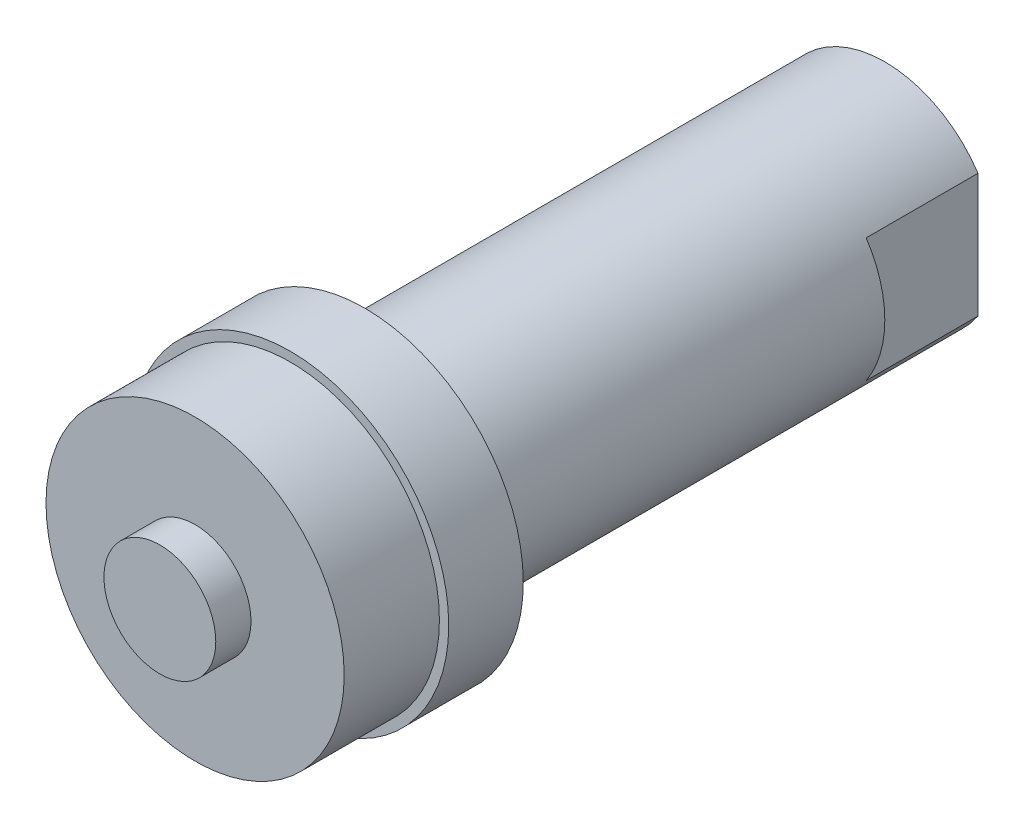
ISO-10303-21;
HEADER;
FILE_DESCRIPTION(('STEP AP214'),'2;1');
FILE_NAME('part.step','',(''),(''),'','','');
FILE_SCHEMA(('AUTOMOTIVE_DESIGN { 1 0 10303 214 1 1 1 1 }'));
ENDSEC;
DATA;
#1=APPLICATION_CONTEXT('core data for automotive mechanical design processes');
#2=APPLICATION_PROTOCOL_DEFINITION('international standard','automotive_design',2000,#1);
#3=PRODUCT_CONTEXT('',#1,'mechanical');
#4=PRODUCT('Part','Part','',(#3));
#5=PRODUCT_RELATED_PRODUCT_CATEGORY('part','',(#4));
#6=PRODUCT_DEFINITION_FORMATION('','',#4);
#7=PRODUCT_DEFINITION_CONTEXT('part definition',#1,'design');
#8=PRODUCT_DEFINITION('design','',#6,#7);
#9=PRODUCT_DEFINITION_SHAPE('','',#8);
#10=(LENGTH_UNIT() NAMED_UNIT(*) SI_UNIT(.MILLI.,.METRE.));
#11=(NAMED_UNIT(*) PLANE_ANGLE_UNIT() SI_UNIT($,.RADIAN.));
#12=(NAMED_UNIT(*) SI_UNIT($,.STERADIAN.) SOLID_ANGLE_UNIT());
#13=UNCERTAINTY_MEASURE_WITH_UNIT(LENGTH_MEASURE(1.E-05),#10,'distance_accuracy_value','');
#14=(GEOMETRIC_REPRESENTATION_CONTEXT(3) GLOBAL_UNCERTAINTY_ASSIGNED_CONTEXT((#13)) GLOBAL_UNIT_ASSIGNED_CONTEXT((#10,
#11,#12)) REPRESENTATION_CONTEXT('',''));
#15=CARTESIAN_POINT('',(0.,0.,0.));
#16=DIRECTION('',(0.,0.,1.));
#17=DIRECTION('',(1.,0.,0.));
#18=AXIS2_PLACEMENT_3D('',#15,#16,#17);
#19=CARTESIAN_POINT('',(0.,0.,-15.9));
#20=DIRECTION('',(0.,0.,-1.));
#21=DIRECTION('',(-1.,0.,0.));
#22=AXIS2_PLACEMENT_3D('',#19,#20,#21);
#23=PLANE('',#22);
#24=CARTESIAN_POINT('',(0.,0.,-15.8999999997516));
#25=DIRECTION('',(0.,0.,-1.));
#26=DIRECTION('',(-1.,0.,0.));
#27=AXIS2_PLACEMENT_3D('',#24,#25,#26);
#28=CIRCLE('',#27,3.);
#29=CARTESIAN_POINT('',(-3.,0.,-15.8999999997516));
#30=VERTEX_POINT('',#29);
#31=EDGE_CURVE('E18',#30,#30,#28,.F.);
#32=ORIENTED_EDGE('',*,*,#31,.F.);
#33=EDGE_LOOP('',(#32));
#34=FACE_BOUND('',#33,.T.);
#35=ADVANCED_FACE('F14',(#34),#23,.T.);
#36=CARTESIAN_POINT('',(0.,0.,-15.9));
#37=DIRECTION('',(0.,0.,-1.));
#38=DIRECTION('',(-1.,0.,0.));
#39=AXIS2_PLACEMENT_3D('',#36,#37,#38);
#40=CYLINDRICAL_SURFACE('',#39,3.);
#41=ORIENTED_EDGE('',*,*,#31,.T.);
#42=EDGE_LOOP('',(#41));
#43=FACE_BOUND('',#42,.T.);
#44=CARTESIAN_POINT('',(0.,0.,-27.9));
#45=DIRECTION('',(0.,0.,-1.));
#46=DIRECTION('',(-1.,0.,0.));
#47=AXIS2_PLACEMENT_3D('',#44,#45,#46);
#48=CIRCLE('',#47,3.);
#49=CARTESIAN_POINT('',(-3.,0.,-27.9));
#50=VERTEX_POINT('',#49);
#51=EDGE_CURVE('E107',#50,#50,#48,.F.);
#52=ORIENTED_EDGE('',*,*,#51,.F.);
#53=EDGE_LOOP('',(#52));
#54=FACE_BOUND('',#53,.T.);
#55=ADVANCED_FACE('F244',(#43,#54),#40,.F.);
#56=CARTESIAN_POINT('',(-6.,-7.5,-21.9));
#57=DIRECTION('',(0.,0.,1.));
#58=DIRECTION('',(1.,0.,0.));
#59=AXIS2_PLACEMENT_3D('',#56,#57,#58);
#60=PLANE('',#59);
#61=DIRECTION('',(0.,1.,0.));
#62=VECTOR('',#61,1.);
#63=CARTESIAN_POINT('',(-5.,-7.5,-21.9));
#64=LINE('',#63,#62);
#65=CARTESIAN_POINT('',(-5.00000000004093,-3.316624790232,-21.8999999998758));
#66=VERTEX_POINT('',#65);
#67=CARTESIAN_POINT('',(-5.00000000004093,3.316624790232,-21.8999999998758));
#68=VERTEX_POINT('',#67);
#69=EDGE_CURVE('E84',#66,#68,#64,.T.);
#70=ORIENTED_EDGE('',*,*,#69,.F.);
#71=CARTESIAN_POINT('',(0.,0.,-21.8999999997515));
#72=DIRECTION('',(0.,0.,1.));
#73=DIRECTION('',(1.,0.,0.));
#74=AXIS2_PLACEMENT_3D('',#71,#72,#73);
#75=CIRCLE('',#74,6.);
#76=EDGE_CURVE('E78',#68,#66,#75,.T.);
#77=ORIENTED_EDGE('',*,*,#76,.F.);
#78=EDGE_LOOP('',(#70,#77));
#79=FACE_BOUND('',#78,.T.);
#80=ADVANCED_FACE('F127',(#79),#60,.F.);
#81=CARTESIAN_POINT('',(-5.,-7.5,-21.9));
#82=DIRECTION('',(1.,0.,0.));
#83=DIRECTION('',(0.,0.,-1.));
#84=AXIS2_PLACEMENT_3D('',#81,#82,#83);
#85=PLANE('',#84);
#86=ORIENTED_EDGE('',*,*,#69,.T.);
#87=DIRECTION('',(0.,0.,1.));
#88=VECTOR('',#87,1.);
#89=CARTESIAN_POINT('',(-5.00000000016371,3.3166247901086,-13.95));
#90=LINE('',#89,#88);
#91=CARTESIAN_POINT('',(-5.00000000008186,3.316624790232,-27.9));
#92=VERTEX_POINT('',#91);
#93=EDGE_CURVE('E72',#92,#68,#90,.T.);
#94=ORIENTED_EDGE('',*,*,#93,.F.);
#95=DIRECTION('',(0.,1.,0.));
#96=VECTOR('',#95,1.);
#97=CARTESIAN_POINT('',(-5.,0.,-27.9));
#98=LINE('',#97,#96);
#99=CARTESIAN_POINT('',(-5.00000000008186,-3.316624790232,-27.9));
#100=VERTEX_POINT('',#99);
#101=EDGE_CURVE('E61',#100,#92,#98,.T.);
#102=ORIENTED_EDGE('',*,*,#101,.F.);
#103=DIRECTION('',(0.,0.,-1.));
#104=VECTOR('',#103,1.);
#105=CARTESIAN_POINT('',(-5.00000000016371,-3.3166247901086,-13.95));
#106=LINE('',#105,#104);
#107=EDGE_CURVE('E66',#66,#100,#106,.T.);
#108=ORIENTED_EDGE('',*,*,#107,.F.);
#109=EDGE_LOOP('',(#86,#94,#102,#108));
#110=FACE_BOUND('',#109,.T.);
#111=ADVANCED_FACE('F70',(#110),#85,.F.);
#112=CARTESIAN_POINT('',(6.,-7.5,-21.9));
#113=DIRECTION('',(0.,0.,1.));
#114=DIRECTION('',(1.,0.,0.));
#115=AXIS2_PLACEMENT_3D('',#112,#113,#114);
#116=PLANE('',#115);
#117=CARTESIAN_POINT('',(0.,0.,-21.8999999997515));
#118=DIRECTION('',(0.,0.,1.));
#119=DIRECTION('',(1.,0.,0.));
#120=AXIS2_PLACEMENT_3D('',#117,#118,#119);
#121=CIRCLE('',#120,6.);
#122=CARTESIAN_POINT('',(5.00000000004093,-3.316624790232,-21.8999999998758));
#123=VERTEX_POINT('',#122);
#124=CARTESIAN_POINT('',(5.00000000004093,3.316624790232,-21.8999999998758));
#125=VERTEX_POINT('',#124);
#126=EDGE_CURVE('E105',#123,#125,#121,.T.);
#127=ORIENTED_EDGE('',*,*,#126,.F.);
#128=DIRECTION('',(0.,1.,0.));
#129=VECTOR('',#128,1.);
#130=CARTESIAN_POINT('',(5.,-7.5,-21.9));
#131=LINE('',#130,#129);
#132=EDGE_CURVE('E73',#125,#123,#131,.F.);
#133=ORIENTED_EDGE('',*,*,#132,.F.);
#134=EDGE_LOOP('',(#127,#133));
#135=FACE_BOUND('',#134,.T.);
#136=ADVANCED_FACE('F117',(#135),#116,.F.);
#137=CARTESIAN_POINT('',(5.,-7.5,-21.9));
#138=DIRECTION('',(-1.,0.,0.));
#139=DIRECTION('',(0.,0.,1.));
#140=AXIS2_PLACEMENT_3D('',#137,#138,#139);
#141=PLANE('',#140);
#142=ORIENTED_EDGE('',*,*,#132,.T.);
#143=DIRECTION('',(0.,0.,1.));
#144=VECTOR('',#143,1.);
#145=CARTESIAN_POINT('',(5.00000000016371,-3.3166247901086,-13.95));
#146=LINE('',#145,#144);
#147=CARTESIAN_POINT('',(5.00000000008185,-3.316624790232,-27.9));
#148=VERTEX_POINT('',#147);
#149=EDGE_CURVE('E65',#148,#123,#146,.T.);
#150=ORIENTED_EDGE('',*,*,#149,.F.);
#151=DIRECTION('',(0.,1.,0.));
#152=VECTOR('',#151,1.);
#153=CARTESIAN_POINT('',(5.,0.,-27.9));
#154=LINE('',#153,#152);
#155=CARTESIAN_POINT('',(5.00000000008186,3.316624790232,-27.9));
#156=VERTEX_POINT('',#155);
#157=EDGE_CURVE('E33',#156,#148,#154,.F.);
#158=ORIENTED_EDGE('',*,*,#157,.F.);
#159=DIRECTION('',(0.,0.,-1.));
#160=VECTOR('',#159,1.);
#161=CARTESIAN_POINT('',(5.00000000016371,3.3166247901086,-13.95));
#162=LINE('',#161,#160);
#163=EDGE_CURVE('E104',#125,#156,#162,.T.);
#164=ORIENTED_EDGE('',*,*,#163,.F.);
#165=EDGE_LOOP('',(#142,#150,#158,#164));
#166=FACE_BOUND('',#165,.T.);
#167=ADVANCED_FACE('F115',(#166),#141,.F.);
#168=CARTESIAN_POINT('',(0.,0.,-27.9));
#169=DIRECTION('',(0.,0.,1.));
#170=DIRECTION('',(1.,0.,0.));
#171=AXIS2_PLACEMENT_3D('',#168,#169,#170);
#172=PLANE('',#171);
#173=ORIENTED_EDGE('',*,*,#51,.T.);
#174=EDGE_LOOP('',(#173));
#175=FACE_BOUND('',#174,.T.);
#176=ORIENTED_EDGE('',*,*,#157,.T.);
#177=CARTESIAN_POINT('',(0.,0.,-27.9));
#178=DIRECTION('',(0.,0.,1.));
#179=DIRECTION('',(1.,0.,0.));
#180=AXIS2_PLACEMENT_3D('',#177,#178,#179);
#181=CIRCLE('',#180,6.);
#182=EDGE_CURVE('E58',#100,#148,#181,.T.);
#183=ORIENTED_EDGE('',*,*,#182,.F.);
#184=ORIENTED_EDGE('',*,*,#101,.T.);
#185=CARTESIAN_POINT('',(0.,0.,-27.9));
#186=DIRECTION('',(0.,0.,1.));
#187=DIRECTION('',(1.,0.,0.));
#188=AXIS2_PLACEMENT_3D('',#185,#186,#187);
#189=CIRCLE('',#188,6.);
#190=EDGE_CURVE('E53',#156,#92,#189,.T.);
#191=ORIENTED_EDGE('',*,*,#190,.F.);
#192=EDGE_LOOP('',(#176,#183,#184,#191));
#193=FACE_BOUND('',#192,.T.);
#194=ADVANCED_FACE('F60',(#175,#193),#172,.F.);
#195=CARTESIAN_POINT('',(0.,0.,0.));
#196=DIRECTION('',(0.,0.,1.));
#197=DIRECTION('',(1.,0.,0.));
#198=AXIS2_PLACEMENT_3D('',#195,#196,#197);
#199=CYLINDRICAL_SURFACE('',#198,6.);
#200=ORIENTED_EDGE('',*,*,#107,.T.);
#201=ORIENTED_EDGE('',*,*,#182,.T.);
#202=ORIENTED_EDGE('',*,*,#149,.T.);
#203=ORIENTED_EDGE('',*,*,#126,.T.);
#204=ORIENTED_EDGE('',*,*,#163,.T.);
#205=ORIENTED_EDGE('',*,*,#190,.T.);
#206=ORIENTED_EDGE('',*,*,#93,.T.);
#207=ORIENTED_EDGE('',*,*,#76,.T.);
#208=EDGE_LOOP('',(#200,#201,#202,#203,#204,#205,#206,#207));
#209=FACE_BOUND('',#208,.T.);
#210=CARTESIAN_POINT('',(0.,0.,0.));
#211=DIRECTION('',(0.,0.,1.));
#212=DIRECTION('',(1.,0.,0.));
#213=AXIS2_PLACEMENT_3D('',#210,#211,#212);
#214=CIRCLE('',#213,6.);
#215=CARTESIAN_POINT('',(6.,0.,0.));
#216=VERTEX_POINT('',#215);
#217=EDGE_CURVE('E100',#216,#216,#214,.T.);
#218=ORIENTED_EDGE('',*,*,#217,.F.);
#219=EDGE_LOOP('',(#218));
#220=FACE_BOUND('',#219,.T.);
#221=ADVANCED_FACE('F75',(#209,#220),#199,.T.);
#222=CARTESIAN_POINT('',(0.,0.,11.));
#223=DIRECTION('',(0.,0.,-1.));
#224=DIRECTION('',(-1.,0.,0.));
#225=AXIS2_PLACEMENT_3D('',#222,#223,#224);
#226=PLANE('',#225);
#227=CARTESIAN_POINT('',(0.,0.,11.));
#228=DIRECTION('',(0.,0.,1.));
#229=DIRECTION('',(1.,0.,0.));
#230=AXIS2_PLACEMENT_3D('',#227,#228,#229);
#231=CIRCLE('',#230,3.);
#232=CARTESIAN_POINT('',(3.,0.,11.));
#233=VERTEX_POINT('',#232);
#234=EDGE_CURVE('E97',#233,#233,#231,.F.);
#235=ORIENTED_EDGE('',*,*,#234,.F.);
#236=EDGE_LOOP('',(#235));
#237=FACE_BOUND('',#236,.T.);
#238=ADVANCED_FACE('F160',(#237),#226,.F.);
#239=CARTESIAN_POINT('',(0.,8.5,0.));
#240=DIRECTION('',(0.,0.,1.));
#241=DIRECTION('',(1.,0.,0.));
#242=AXIS2_PLACEMENT_3D('',#239,#240,#241);
#243=PLANE('',#242);
#244=ORIENTED_EDGE('',*,*,#217,.T.);
#245=EDGE_LOOP('',(#244));
#246=FACE_BOUND('',#245,.T.);
#247=CARTESIAN_POINT('',(0.,0.,0.));
#248=DIRECTION('',(0.,0.,1.));
#249=DIRECTION('',(1.,0.,0.));
#250=AXIS2_PLACEMENT_3D('',#247,#248,#249);
#251=CIRCLE('',#250,8.5);
#252=CARTESIAN_POINT('',(8.5,0.,0.));
#253=VERTEX_POINT('',#252);
#254=EDGE_CURVE('E94',#253,#253,#251,.T.);
#255=ORIENTED_EDGE('',*,*,#254,.F.);
#256=EDGE_LOOP('',(#255));
#257=FACE_BOUND('',#256,.T.);
#258=ADVANCED_FACE('F156',(#246,#257),#243,.F.);
#259=CARTESIAN_POINT('',(0.,0.,11.));
#260=DIRECTION('',(0.,0.,1.));
#261=DIRECTION('',(1.,0.,0.));
#262=AXIS2_PLACEMENT_3D('',#259,#260,#261);
#263=CYLINDRICAL_SURFACE('',#262,3.);
#264=ORIENTED_EDGE('',*,*,#234,.T.);
#265=EDGE_LOOP('',(#264));
#266=FACE_BOUND('',#265,.T.);
#267=CARTESIAN_POINT('',(0.,0.,9.11));
#268=DIRECTION('',(0.,0.,1.));
#269=DIRECTION('',(1.,0.,0.));
#270=AXIS2_PLACEMENT_3D('',#267,#268,#269);
#271=CIRCLE('',#270,3.);
#272=CARTESIAN_POINT('',(3.,0.,9.11));
#273=VERTEX_POINT('',#272);
#274=EDGE_CURVE('E91',#273,#273,#271,.F.);
#275=ORIENTED_EDGE('',*,*,#274,.F.);
#276=EDGE_LOOP('',(#275));
#277=FACE_BOUND('',#276,.T.);
#278=ADVANCED_FACE('F150',(#266,#277),#263,.T.);
#279=CARTESIAN_POINT('',(0.,0.,4.));
#280=DIRECTION('',(0.,0.,1.));
#281=DIRECTION('',(1.,0.,0.));
#282=AXIS2_PLACEMENT_3D('',#279,#280,#281);
#283=CYLINDRICAL_SURFACE('',#282,8.5);
#284=ORIENTED_EDGE('',*,*,#254,.T.);
#285=EDGE_LOOP('',(#284));
#286=FACE_BOUND('',#285,.T.);
#287=CARTESIAN_POINT('',(0.,0.,4.));
#288=DIRECTION('',(0.,0.,1.));
#289=DIRECTION('',(1.,0.,0.));
#290=AXIS2_PLACEMENT_3D('',#287,#288,#289);
#291=CIRCLE('',#290,8.5);
#292=CARTESIAN_POINT('',(8.5,0.,4.));
#293=VERTEX_POINT('',#292);
#294=EDGE_CURVE('E88',#293,#293,#291,.T.);
#295=ORIENTED_EDGE('',*,*,#294,.F.);
#296=EDGE_LOOP('',(#295));
#297=FACE_BOUND('',#296,.T.);
#298=ADVANCED_FACE('F143',(#286,#297),#283,.T.);
#299=CARTESIAN_POINT('',(0.,0.,9.11));
#300=DIRECTION('',(0.,0.,1.));
#301=DIRECTION('',(1.,0.,0.));
#302=AXIS2_PLACEMENT_3D('',#299,#300,#301);
#303=PLANE('',#302);
#304=ORIENTED_EDGE('',*,*,#274,.T.);
#305=EDGE_LOOP('',(#304));
#306=FACE_BOUND('',#305,.T.);
#307=CARTESIAN_POINT('',(0.,0.,9.11));
#308=DIRECTION('',(0.,0.,-1.));
#309=DIRECTION('',(-1.,0.,0.));
#310=AXIS2_PLACEMENT_3D('',#307,#308,#309);
#311=CIRCLE('',#310,8.);
#312=CARTESIAN_POINT('',(-8.,0.,9.11));
#313=VERTEX_POINT('',#312);
#314=EDGE_CURVE('E24',#313,#313,#311,.T.);
#315=ORIENTED_EDGE('',*,*,#314,.F.);
#316=EDGE_LOOP('',(#315));
#317=FACE_BOUND('',#316,.T.);
#318=ADVANCED_FACE('F136',(#306,#317),#303,.T.);
#319=CARTESIAN_POINT('',(0.,3.,4.));
#320=DIRECTION('',(0.,0.,-1.));
#321=DIRECTION('',(-1.,0.,0.));
#322=AXIS2_PLACEMENT_3D('',#319,#320,#321);
#323=PLANE('',#322);
#324=CARTESIAN_POINT('',(0.,0.,4.00000000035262));
#325=DIRECTION('',(0.,0.,-1.));
#326=DIRECTION('',(-1.,0.,0.));
#327=AXIS2_PLACEMENT_3D('',#324,#325,#326);
#328=CIRCLE('',#327,8.);
#329=CARTESIAN_POINT('',(-8.,0.,4.00000000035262));
#330=VERTEX_POINT('',#329);
#331=EDGE_CURVE('E9',#330,#330,#328,.F.);
#332=ORIENTED_EDGE('',*,*,#331,.F.);
#333=EDGE_LOOP('',(#332));
#334=FACE_BOUND('',#333,.T.);
#335=ORIENTED_EDGE('',*,*,#294,.T.);
#336=EDGE_LOOP('',(#335));
#337=FACE_BOUND('',#336,.T.);
#338=ADVANCED_FACE('F130',(#334,#337),#323,.F.);
#339=CARTESIAN_POINT('',(0.,0.,4.));
#340=DIRECTION('',(0.,0.,-1.));
#341=DIRECTION('',(-1.,0.,0.));
#342=AXIS2_PLACEMENT_3D('',#339,#340,#341);
#343=CYLINDRICAL_SURFACE('',#342,8.);
#344=ORIENTED_EDGE('',*,*,#331,.T.);
#345=EDGE_LOOP('',(#344));
#346=FACE_BOUND('',#345,.T.);
#347=ORIENTED_EDGE('',*,*,#314,.T.);
#348=EDGE_LOOP('',(#347));
#349=FACE_BOUND('',#348,.T.);
#350=ADVANCED_FACE('F16',(#346,#349),#343,.T.);
#351=CLOSED_SHELL('',(#35,#55,#80,#111,#136,#167,#194,#221,#238,#258,#278,#298,#318,#338,#350));
#352=MANIFOLD_SOLID_BREP('B1',#351);
#353=ADVANCED_BREP_SHAPE_REPRESENTATION('',(#18,#352),#14);
#354=SHAPE_DEFINITION_REPRESENTATION(#9,#353);
ENDSEC;
END-ISO-10303-21;
